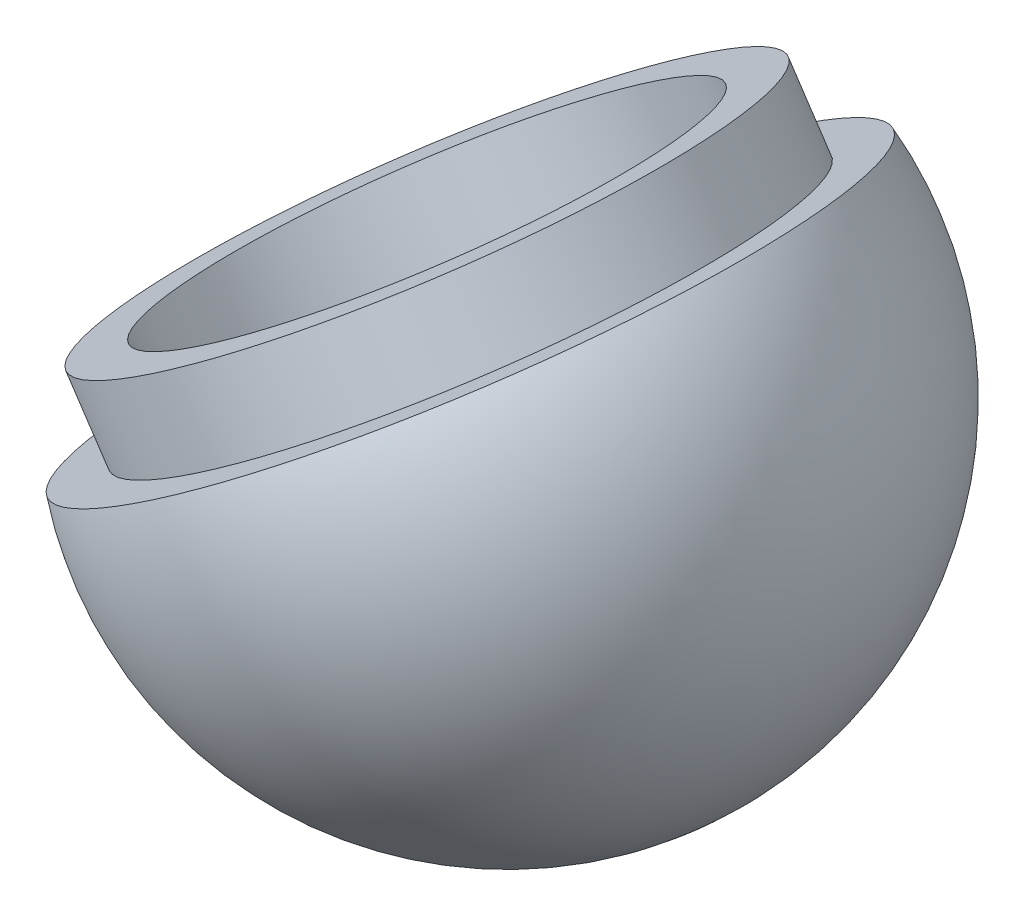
ISO-10303-21;
HEADER;
FILE_DESCRIPTION(('STEP AP214'),'2;1');
FILE_NAME('part.step','',(''),(''),'','','');
FILE_SCHEMA(('AUTOMOTIVE_DESIGN { 1 0 10303 214 1 1 1 1 }'));
ENDSEC;
DATA;
#1=APPLICATION_CONTEXT('core data for automotive mechanical design processes');
#2=APPLICATION_PROTOCOL_DEFINITION('international standard','automotive_design',2000,#1);
#3=PRODUCT_CONTEXT('',#1,'mechanical');
#4=PRODUCT('Part','Part','',(#3));
#5=PRODUCT_RELATED_PRODUCT_CATEGORY('part','',(#4));
#6=PRODUCT_DEFINITION_FORMATION('','',#4);
#7=PRODUCT_DEFINITION_CONTEXT('part definition',#1,'design');
#8=PRODUCT_DEFINITION('design','',#6,#7);
#9=PRODUCT_DEFINITION_SHAPE('','',#8);
#10=(LENGTH_UNIT() NAMED_UNIT(*) SI_UNIT(.MILLI.,.METRE.));
#11=(NAMED_UNIT(*) PLANE_ANGLE_UNIT() SI_UNIT($,.RADIAN.));
#12=(NAMED_UNIT(*) SI_UNIT($,.STERADIAN.) SOLID_ANGLE_UNIT());
#13=UNCERTAINTY_MEASURE_WITH_UNIT(LENGTH_MEASURE(1.E-05),#10,'distance_accuracy_value','');
#14=(GEOMETRIC_REPRESENTATION_CONTEXT(3) GLOBAL_UNCERTAINTY_ASSIGNED_CONTEXT((#13)) GLOBAL_UNIT_ASSIGNED_CONTEXT((#10,
#11,#12)) REPRESENTATION_CONTEXT('',''));
#15=CARTESIAN_POINT('',(0.,0.,0.));
#16=DIRECTION('',(0.,0.,1.));
#17=DIRECTION('',(1.,0.,0.));
#18=AXIS2_PLACEMENT_3D('',#15,#16,#17);
#19=CARTESIAN_POINT('',(0.,0.,0.));
#20=DIRECTION('',(-0.556232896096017,0.831026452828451,0.));
#21=DIRECTION('',(-0.831026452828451,-0.556232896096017,0.));
#22=AXIS2_PLACEMENT_3D('',#19,#20,#21);
#23=SPHERICAL_SURFACE('',#22,50.);
#24=CARTESIAN_POINT('',(-5.56232896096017,8.31026452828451,0.));
#25=DIRECTION('',(-0.556232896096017,0.831026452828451,0.));
#26=DIRECTION('',(-0.831026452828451,-0.556232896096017,0.));
#27=AXIS2_PLACEMENT_3D('',#24,#25,#26);
#28=CIRCLE('',#27,48.9897948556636);
#29=CARTESIAN_POINT('',(-46.2741444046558,-18.939470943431,0.));
#30=VERTEX_POINT('',#29);
#31=EDGE_CURVE('E10',#30,#30,#28,.T.);
#32=ORIENTED_EDGE('',*,*,#31,.F.);
#33=EDGE_LOOP('',(#32));
#34=FACE_BOUND('',#33,.T.);
#35=ADVANCED_FACE('F34',(#34),#23,.T.);
#36=CARTESIAN_POINT('',(35.1494864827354,35.56,0.));
#37=DIRECTION('',(0.556232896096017,-0.831026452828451,0.));
#38=DIRECTION('',(0.831026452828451,0.556232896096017,0.));
#39=AXIS2_PLACEMENT_3D('',#36,#37,#38);
#40=PLANE('',#39);
#41=CARTESIAN_POINT('',(-5.56232896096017,8.31026452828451,0.));
#42=DIRECTION('',(-0.556232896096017,0.831026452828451,0.));
#43=DIRECTION('',(-0.831026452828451,-0.556232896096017,0.));
#44=AXIS2_PLACEMENT_3D('',#41,#42,#43);
#45=CIRCLE('',#44,41.821047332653);
#46=CARTESIAN_POINT('',(-40.3167255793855,-14.9519777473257,0.));
#47=VERTEX_POINT('',#46);
#48=EDGE_CURVE('E40',#47,#47,#45,.T.);
#49=ORIENTED_EDGE('',*,*,#48,.F.);
#50=EDGE_LOOP('',(#49));
#51=FACE_BOUND('',#50,.T.);
#52=ORIENTED_EDGE('',*,*,#31,.T.);
#53=EDGE_LOOP('',(#52));
#54=FACE_BOUND('',#53,.T.);
#55=ADVANCED_FACE('F73',(#51,#54),#40,.F.);
#56=CARTESIAN_POINT('',(0.,0.,0.));
#57=DIRECTION('',(-0.556232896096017,0.831026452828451,0.));
#58=DIRECTION('',(-0.831026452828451,-0.556232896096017,0.));
#59=AXIS2_PLACEMENT_3D('',#56,#57,#58);
#60=CYLINDRICAL_SURFACE('',#59,41.821047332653);
#61=CARTESIAN_POINT('',(-12.0598826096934,18.017779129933,0.));
#62=DIRECTION('',(-0.556232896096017,0.831026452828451,0.));
#63=DIRECTION('',(-0.831026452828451,-0.556232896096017,0.));
#64=AXIS2_PLACEMENT_3D('',#61,#62,#63);
#65=CIRCLE('',#64,41.821047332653);
#66=CARTESIAN_POINT('',(-46.8142792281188,-5.24446314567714,0.));
#67=VERTEX_POINT('',#66);
#68=EDGE_CURVE('E44',#67,#67,#65,.T.);
#69=ORIENTED_EDGE('',*,*,#68,.F.);
#70=EDGE_LOOP('',(#69));
#71=FACE_BOUND('',#70,.T.);
#72=ORIENTED_EDGE('',*,*,#48,.T.);
#73=EDGE_LOOP('',(#72));
#74=FACE_BOUND('',#73,.T.);
#75=ADVANCED_FACE('F68',(#71,#74),#60,.T.);
#76=CARTESIAN_POINT('',(22.694514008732,41.2800214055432,0.));
#77=DIRECTION('',(0.556232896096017,-0.831026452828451,0.));
#78=DIRECTION('',(0.831026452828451,0.556232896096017,0.));
#79=AXIS2_PLACEMENT_3D('',#76,#77,#78);
#80=PLANE('',#79);
#81=CARTESIAN_POINT('',(-12.0598826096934,18.017779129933,0.));
#82=DIRECTION('',(-0.556232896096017,0.831026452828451,0.));
#83=DIRECTION('',(-0.831026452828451,-0.556232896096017,0.));
#84=AXIS2_PLACEMENT_3D('',#81,#82,#83);
#85=CIRCLE('',#84,34.5832329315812);
#86=CARTESIAN_POINT('',(-40.7994640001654,-1.21855267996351,0.));
#87=VERTEX_POINT('',#86);
#88=EDGE_CURVE('E48',#87,#87,#85,.T.);
#89=ORIENTED_EDGE('',*,*,#88,.F.);
#90=EDGE_LOOP('',(#89));
#91=FACE_BOUND('',#90,.T.);
#92=ORIENTED_EDGE('',*,*,#68,.T.);
#93=EDGE_LOOP('',(#92));
#94=FACE_BOUND('',#93,.T.);
#95=ADVANCED_FACE('F62',(#91,#94),#80,.F.);
#96=CARTESIAN_POINT('',(0.,0.,0.));
#97=DIRECTION('',(-0.556232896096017,0.831026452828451,0.));
#98=DIRECTION('',(-0.831026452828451,-0.556232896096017,0.));
#99=AXIS2_PLACEMENT_3D('',#96,#97,#98);
#100=CYLINDRICAL_SURFACE('',#99,34.5832329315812);
#101=CARTESIAN_POINT('',(-5.56232896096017,8.31026452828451,0.));
#102=DIRECTION('',(-0.556232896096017,0.831026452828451,0.));
#103=DIRECTION('',(-0.831026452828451,-0.556232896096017,0.));
#104=AXIS2_PLACEMENT_3D('',#101,#102,#103);
#105=CIRCLE('',#104,34.5832329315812);
#106=CARTESIAN_POINT('',(-34.3019103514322,-10.926067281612,0.));
#107=VERTEX_POINT('',#106);
#108=EDGE_CURVE('E53',#107,#107,#105,.T.);
#109=ORIENTED_EDGE('',*,*,#108,.F.);
#110=EDGE_LOOP('',(#109));
#111=FACE_BOUND('',#110,.T.);
#112=ORIENTED_EDGE('',*,*,#88,.T.);
#113=EDGE_LOOP('',(#112));
#114=FACE_BOUND('',#113,.T.);
#115=ADVANCED_FACE('F59',(#111,#114),#100,.F.);
#116=CARTESIAN_POINT('',(0.,0.,0.));
#117=DIRECTION('',(-0.556232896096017,0.831026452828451,0.));
#118=DIRECTION('',(0.831026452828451,0.556232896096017,0.));
#119=AXIS2_PLACEMENT_3D('',#116,#117,#118);
#120=SPHERICAL_SURFACE('',#119,36.);
#121=ORIENTED_EDGE('',*,*,#108,.T.);
#122=EDGE_LOOP('',(#121));
#123=FACE_BOUND('',#122,.T.);
#124=ADVANCED_FACE('F57',(#123),#120,.F.);
#125=CLOSED_SHELL('',(#35,#55,#75,#95,#115,#124));
#126=MANIFOLD_SOLID_BREP('B2',#125);
#127=ADVANCED_BREP_SHAPE_REPRESENTATION('',(#18,#126),#14);
#128=SHAPE_DEFINITION_REPRESENTATION(#9,#127);
ENDSEC;
END-ISO-10303-21;
